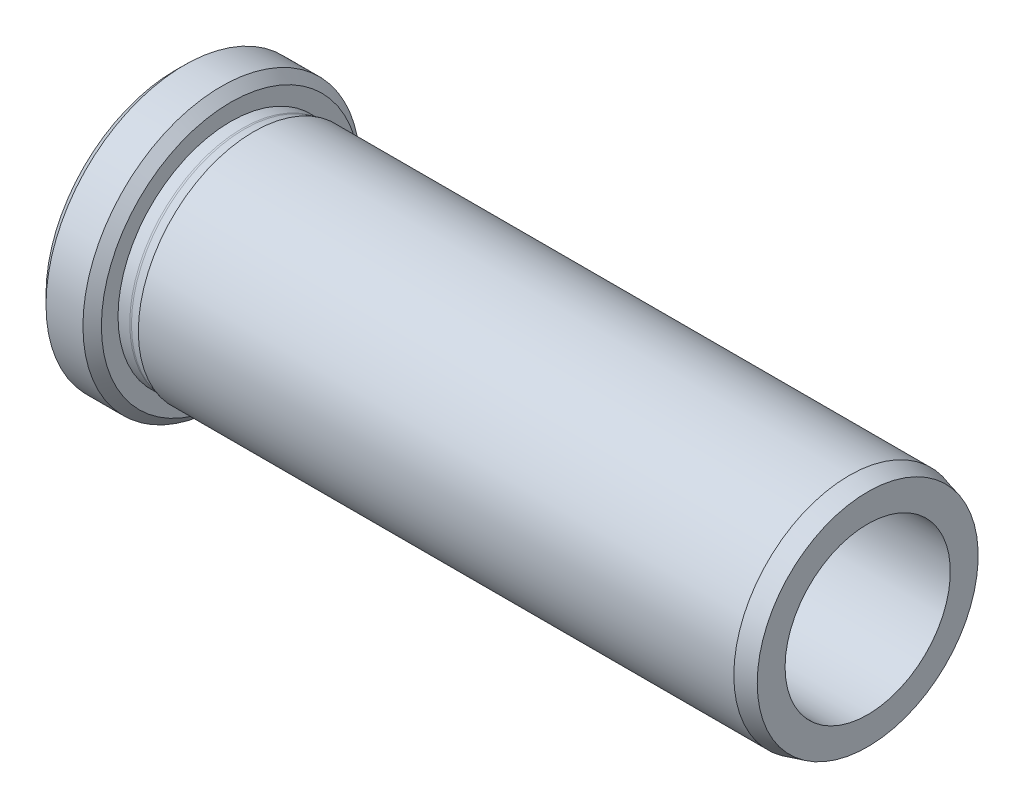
ISO-10303-21;
HEADER;
FILE_DESCRIPTION(('STEP AP214'),'2;1');
FILE_NAME('part.step','',(''),(''),'','','');
FILE_SCHEMA(('AUTOMOTIVE_DESIGN { 1 0 10303 214 1 1 1 1 }'));
ENDSEC;
DATA;
#1=APPLICATION_CONTEXT('core data for automotive mechanical design processes');
#2=APPLICATION_PROTOCOL_DEFINITION('international standard','automotive_design',2000,#1);
#3=PRODUCT_CONTEXT('',#1,'mechanical');
#4=PRODUCT('Part','Part','',(#3));
#5=PRODUCT_RELATED_PRODUCT_CATEGORY('part','',(#4));
#6=PRODUCT_DEFINITION_FORMATION('','',#4);
#7=PRODUCT_DEFINITION_CONTEXT('part definition',#1,'design');
#8=PRODUCT_DEFINITION('design','',#6,#7);
#9=PRODUCT_DEFINITION_SHAPE('','',#8);
#10=(LENGTH_UNIT() NAMED_UNIT(*) SI_UNIT(.MILLI.,.METRE.));
#11=(NAMED_UNIT(*) PLANE_ANGLE_UNIT() SI_UNIT($,.RADIAN.));
#12=(NAMED_UNIT(*) SI_UNIT($,.STERADIAN.) SOLID_ANGLE_UNIT());
#13=UNCERTAINTY_MEASURE_WITH_UNIT(LENGTH_MEASURE(1.E-05),#10,'distance_accuracy_value','');
#14=(GEOMETRIC_REPRESENTATION_CONTEXT(3) GLOBAL_UNCERTAINTY_ASSIGNED_CONTEXT((#13)) GLOBAL_UNIT_ASSIGNED_CONTEXT((#10,
#11,#12)) REPRESENTATION_CONTEXT('',''));
#15=CARTESIAN_POINT('',(0.,0.,0.));
#16=DIRECTION('',(0.,0.,1.));
#17=DIRECTION('',(1.,0.,0.));
#18=AXIS2_PLACEMENT_3D('',#15,#16,#17);
#19=CARTESIAN_POINT('',(30.8004766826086,8.95,0.));
#20=DIRECTION('',(1.,0.,0.));
#21=DIRECTION('',(0.,0.,-1.));
#22=AXIS2_PLACEMENT_3D('',#19,#20,#21);
#23=PLANE('',#22);
#24=CARTESIAN_POINT('',(30.8004766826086,0.,0.));
#25=DIRECTION('',(-1.,0.,0.));
#26=DIRECTION('',(0.,0.,1.));
#27=AXIS2_PLACEMENT_3D('',#24,#25,#26);
#28=CIRCLE('',#27,8.95);
#29=CARTESIAN_POINT('',(30.8004766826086,0.,8.95));
#30=VERTEX_POINT('',#29);
#31=EDGE_CURVE('E64',#30,#30,#28,.T.);
#32=ORIENTED_EDGE('',*,*,#31,.F.);
#33=EDGE_LOOP('',(#32));
#34=FACE_BOUND('',#33,.T.);
#35=CARTESIAN_POINT('',(30.8004766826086,0.,0.));
#36=DIRECTION('',(-1.,0.,0.));
#37=DIRECTION('',(0.,0.,1.));
#38=AXIS2_PLACEMENT_3D('',#35,#36,#37);
#39=CIRCLE('',#38,9.);
#40=CARTESIAN_POINT('',(30.8004766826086,0.,9.));
#41=VERTEX_POINT('',#40);
#42=EDGE_CURVE('E40',#41,#41,#39,.T.);
#43=ORIENTED_EDGE('',*,*,#42,.T.);
#44=EDGE_LOOP('',(#43));
#45=FACE_BOUND('',#44,.T.);
#46=ADVANCED_FACE('F14',(#34,#45),#23,.F.);
#47=CARTESIAN_POINT('',(0.,0.,0.));
#48=DIRECTION('',(-1.,0.,0.));
#49=DIRECTION('',(0.,0.,1.));
#50=AXIS2_PLACEMENT_3D('',#47,#48,#49);
#51=CYLINDRICAL_SURFACE('',#50,9.);
#52=CARTESIAN_POINT('',(2.30047668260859,0.,0.));
#53=DIRECTION('',(1.,0.,0.));
#54=DIRECTION('',(0.,0.,-1.));
#55=AXIS2_PLACEMENT_3D('',#52,#53,#54);
#56=CIRCLE('',#55,9.);
#57=CARTESIAN_POINT('',(2.30047668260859,0.,-9.));
#58=VERTEX_POINT('',#57);
#59=EDGE_CURVE('E29',#58,#58,#56,.F.);
#60=ORIENTED_EDGE('',*,*,#59,.T.);
#61=EDGE_LOOP('',(#60));
#62=FACE_BOUND('',#61,.T.);
#63=ORIENTED_EDGE('',*,*,#42,.F.);
#64=EDGE_LOOP('',(#63));
#65=FACE_BOUND('',#64,.T.);
#66=ADVANCED_FACE('F72',(#62,#65),#51,.F.);
#67=CARTESIAN_POINT('',(0.800476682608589,15.,0.));
#68=DIRECTION('',(1.,0.,0.));
#69=DIRECTION('',(0.,0.,-1.));
#70=AXIS2_PLACEMENT_3D('',#67,#68,#69);
#71=PLANE('',#70);
#72=CARTESIAN_POINT('',(0.800476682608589,0.,0.));
#73=DIRECTION('',(1.,0.,0.));
#74=DIRECTION('',(0.,0.,-1.));
#75=AXIS2_PLACEMENT_3D('',#72,#73,#74);
#76=CIRCLE('',#75,10.5);
#77=CARTESIAN_POINT('',(0.800476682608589,0.,-10.5));
#78=VERTEX_POINT('',#77);
#79=EDGE_CURVE('E25',#78,#78,#76,.T.);
#80=ORIENTED_EDGE('',*,*,#79,.T.);
#81=EDGE_LOOP('',(#80));
#82=FACE_BOUND('',#81,.T.);
#83=CARTESIAN_POINT('',(0.800476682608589,0.,0.));
#84=DIRECTION('',(1.,0.,0.));
#85=DIRECTION('',(0.,0.,-1.));
#86=AXIS2_PLACEMENT_3D('',#83,#84,#85);
#87=CIRCLE('',#86,14.);
#88=CARTESIAN_POINT('',(0.800476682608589,0.,-14.));
#89=VERTEX_POINT('',#88);
#90=EDGE_CURVE('E37',#89,#89,#87,.F.);
#91=ORIENTED_EDGE('',*,*,#90,.T.);
#92=EDGE_LOOP('',(#91));
#93=FACE_BOUND('',#92,.T.);
#94=ADVANCED_FACE('F77',(#82,#93),#71,.F.);
#95=CARTESIAN_POINT('',(0.,0.,0.));
#96=DIRECTION('',(-1.,0.,0.));
#97=DIRECTION('',(0.,0.,1.));
#98=AXIS2_PLACEMENT_3D('',#95,#96,#97);
#99=CYLINDRICAL_SURFACE('',#98,15.);
#100=CARTESIAN_POINT('',(5.8004766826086,0.,0.));
#101=DIRECTION('',(-1.,0.,0.));
#102=DIRECTION('',(0.,0.,1.));
#103=AXIS2_PLACEMENT_3D('',#100,#101,#102);
#104=CIRCLE('',#103,15.);
#105=CARTESIAN_POINT('',(5.8004766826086,0.,15.));
#106=VERTEX_POINT('',#105);
#107=EDGE_CURVE('E21',#106,#106,#104,.T.);
#108=ORIENTED_EDGE('',*,*,#107,.T.);
#109=EDGE_LOOP('',(#108));
#110=FACE_BOUND('',#109,.T.);
#111=CARTESIAN_POINT('',(1.80047668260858,0.,0.));
#112=DIRECTION('',(1.,0.,0.));
#113=DIRECTION('',(0.,0.,-1.));
#114=AXIS2_PLACEMENT_3D('',#111,#112,#113);
#115=CIRCLE('',#114,15.);
#116=CARTESIAN_POINT('',(1.80047668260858,0.,-15.));
#117=VERTEX_POINT('',#116);
#118=EDGE_CURVE('E34',#117,#117,#115,.T.);
#119=ORIENTED_EDGE('',*,*,#118,.T.);
#120=EDGE_LOOP('',(#119));
#121=FACE_BOUND('',#120,.T.);
#122=ADVANCED_FACE('F85',(#110,#121),#99,.T.);
#123=CARTESIAN_POINT('',(6.80047668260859,15.,0.));
#124=DIRECTION('',(-1.,0.,0.));
#125=DIRECTION('',(0.,0.,1.));
#126=AXIS2_PLACEMENT_3D('',#123,#124,#125);
#127=PLANE('',#126);
#128=CARTESIAN_POINT('',(6.80047668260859,0.,0.));
#129=DIRECTION('',(-1.,0.,0.));
#130=DIRECTION('',(0.,0.,1.));
#131=AXIS2_PLACEMENT_3D('',#128,#129,#130);
#132=CIRCLE('',#131,14.);
#133=CARTESIAN_POINT('',(6.80047668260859,0.,14.));
#134=VERTEX_POINT('',#133);
#135=EDGE_CURVE('E9',#134,#134,#132,.F.);
#136=ORIENTED_EDGE('',*,*,#135,.T.);
#137=EDGE_LOOP('',(#136));
#138=FACE_BOUND('',#137,.T.);
#139=CARTESIAN_POINT('',(6.80047668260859,0.,0.));
#140=DIRECTION('',(-1.,0.,0.));
#141=DIRECTION('',(0.,0.,1.));
#142=AXIS2_PLACEMENT_3D('',#139,#140,#141);
#143=CIRCLE('',#142,12.2);
#144=CARTESIAN_POINT('',(6.80047668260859,0.,12.2));
#145=VERTEX_POINT('',#144);
#146=EDGE_CURVE('E43',#145,#145,#143,.T.);
#147=ORIENTED_EDGE('',*,*,#146,.T.);
#148=EDGE_LOOP('',(#147));
#149=FACE_BOUND('',#148,.T.);
#150=ADVANCED_FACE('F124',(#138,#149),#127,.F.);
#151=CARTESIAN_POINT('',(0.,0.,0.));
#152=DIRECTION('',(-1.,0.,0.));
#153=DIRECTION('',(0.,0.,1.));
#154=AXIS2_PLACEMENT_3D('',#151,#152,#153);
#155=CYLINDRICAL_SURFACE('',#154,12.2);
#156=ORIENTED_EDGE('',*,*,#146,.F.);
#157=EDGE_LOOP('',(#156));
#158=FACE_BOUND('',#157,.T.);
#159=CARTESIAN_POINT('',(8.07553944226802,0.,0.));
#160=DIRECTION('',(-1.,0.,0.));
#161=DIRECTION('',(0.,0.,1.));
#162=AXIS2_PLACEMENT_3D('',#159,#160,#161);
#163=CIRCLE('',#162,12.2);
#164=CARTESIAN_POINT('',(8.07553944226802,0.,12.2));
#165=VERTEX_POINT('',#164);
#166=EDGE_CURVE('E46',#165,#165,#163,.T.);
#167=ORIENTED_EDGE('',*,*,#166,.T.);
#168=EDGE_LOOP('',(#167));
#169=FACE_BOUND('',#168,.T.);
#170=ADVANCED_FACE('F129',(#158,#169),#155,.T.);
#171=CARTESIAN_POINT('',(8.07553944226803,0.,0.));
#172=DIRECTION('',(-1.,0.,0.));
#173=DIRECTION('',(0.,0.,1.));
#174=AXIS2_PLACEMENT_3D('',#171,#172,#173);
#175=TOROIDAL_SURFACE('',#174,13.,0.8);
#176=ORIENTED_EDGE('',*,*,#166,.F.);
#177=EDGE_LOOP('',(#176));
#178=FACE_BOUND('',#177,.T.);
#179=CARTESIAN_POINT('',(8.28259467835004,0.,0.));
#180=DIRECTION('',(-1.,0.,0.));
#181=DIRECTION('',(0.,0.,1.));
#182=AXIS2_PLACEMENT_3D('',#179,#180,#181);
#183=CIRCLE('',#182,12.2272593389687);
#184=CARTESIAN_POINT('',(8.28259467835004,0.,12.2272593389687));
#185=VERTEX_POINT('',#184);
#186=EDGE_CURVE('E49',#185,#185,#183,.T.);
#187=ORIENTED_EDGE('',*,*,#186,.T.);
#188=EDGE_LOOP('',(#187));
#189=FACE_BOUND('',#188,.T.);
#190=ADVANCED_FACE('F189',(#178,#189),#175,.F.);
#191=CARTESIAN_POINT('',(9.30047668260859,0.,0.));
#192=DIRECTION('',(1.,0.,0.));
#193=DIRECTION('',(0.,0.,-1.));
#194=AXIS2_PLACEMENT_3D('',#191,#192,#193);
#195=CONICAL_SURFACE('',#194,12.5,0.261799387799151);
#196=ORIENTED_EDGE('',*,*,#186,.F.);
#197=EDGE_LOOP('',(#196));
#198=FACE_BOUND('',#197,.T.);
#199=CARTESIAN_POINT('',(9.30047668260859,0.,0.));
#200=DIRECTION('',(-1.,0.,0.));
#201=DIRECTION('',(0.,0.,1.));
#202=AXIS2_PLACEMENT_3D('',#199,#200,#201);
#203=CIRCLE('',#202,12.5);
#204=CARTESIAN_POINT('',(9.30047668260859,0.,12.5));
#205=VERTEX_POINT('',#204);
#206=EDGE_CURVE('E52',#205,#205,#203,.T.);
#207=ORIENTED_EDGE('',*,*,#206,.T.);
#208=EDGE_LOOP('',(#207));
#209=FACE_BOUND('',#208,.T.);
#210=ADVANCED_FACE('F179',(#198,#209),#195,.T.);
#211=CARTESIAN_POINT('',(0.,0.,0.));
#212=DIRECTION('',(-1.,0.,0.));
#213=DIRECTION('',(0.,0.,1.));
#214=AXIS2_PLACEMENT_3D('',#211,#212,#213);
#215=CYLINDRICAL_SURFACE('',#214,12.5);
#216=ORIENTED_EDGE('',*,*,#206,.F.);
#217=EDGE_LOOP('',(#216));
#218=FACE_BOUND('',#217,.T.);
#219=CARTESIAN_POINT('',(73.8004766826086,0.,0.));
#220=DIRECTION('',(-1.,0.,0.));
#221=DIRECTION('',(0.,0.,1.));
#222=AXIS2_PLACEMENT_3D('',#219,#220,#221);
#223=CIRCLE('',#222,12.5);
#224=CARTESIAN_POINT('',(73.8004766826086,0.,12.5));
#225=VERTEX_POINT('',#224);
#226=EDGE_CURVE('E55',#225,#225,#223,.T.);
#227=ORIENTED_EDGE('',*,*,#226,.T.);
#228=EDGE_LOOP('',(#227));
#229=FACE_BOUND('',#228,.T.);
#230=ADVANCED_FACE('F169',(#218,#229),#215,.T.);
#231=CARTESIAN_POINT('',(75.8004766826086,0.,0.));
#232=DIRECTION('',(-1.,0.,0.));
#233=DIRECTION('',(0.,0.,1.));
#234=AXIS2_PLACEMENT_3D('',#231,#232,#233);
#235=CONICAL_SURFACE('',#234,11.9641016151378,0.26179938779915);
#236=ORIENTED_EDGE('',*,*,#226,.F.);
#237=EDGE_LOOP('',(#236));
#238=FACE_BOUND('',#237,.T.);
#239=CARTESIAN_POINT('',(75.8004766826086,0.,0.));
#240=DIRECTION('',(-1.,0.,0.));
#241=DIRECTION('',(0.,0.,1.));
#242=AXIS2_PLACEMENT_3D('',#239,#240,#241);
#243=CIRCLE('',#242,11.9641016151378);
#244=CARTESIAN_POINT('',(75.8004766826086,0.,11.9641016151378));
#245=VERTEX_POINT('',#244);
#246=EDGE_CURVE('E58',#245,#245,#243,.T.);
#247=ORIENTED_EDGE('',*,*,#246,.T.);
#248=EDGE_LOOP('',(#247));
#249=FACE_BOUND('',#248,.T.);
#250=ADVANCED_FACE('F159',(#238,#249),#235,.T.);
#251=CARTESIAN_POINT('',(75.8004766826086,11.9641016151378,0.));
#252=DIRECTION('',(-1.,0.,0.));
#253=DIRECTION('',(0.,0.,1.));
#254=AXIS2_PLACEMENT_3D('',#251,#252,#253);
#255=PLANE('',#254);
#256=ORIENTED_EDGE('',*,*,#246,.F.);
#257=EDGE_LOOP('',(#256));
#258=FACE_BOUND('',#257,.T.);
#259=CARTESIAN_POINT('',(75.8004766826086,0.,0.));
#260=DIRECTION('',(-1.,0.,0.));
#261=DIRECTION('',(0.,0.,1.));
#262=AXIS2_PLACEMENT_3D('',#259,#260,#261);
#263=CIRCLE('',#262,8.95);
#264=CARTESIAN_POINT('',(75.8004766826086,0.,8.95));
#265=VERTEX_POINT('',#264);
#266=EDGE_CURVE('E61',#265,#265,#263,.T.);
#267=ORIENTED_EDGE('',*,*,#266,.T.);
#268=EDGE_LOOP('',(#267));
#269=FACE_BOUND('',#268,.T.);
#270=ADVANCED_FACE('F148',(#258,#269),#255,.F.);
#271=CARTESIAN_POINT('',(0.,0.,0.));
#272=DIRECTION('',(-1.,0.,0.));
#273=DIRECTION('',(0.,0.,1.));
#274=AXIS2_PLACEMENT_3D('',#271,#272,#273);
#275=CYLINDRICAL_SURFACE('',#274,8.95);
#276=ORIENTED_EDGE('',*,*,#266,.F.);
#277=EDGE_LOOP('',(#276));
#278=FACE_BOUND('',#277,.T.);
#279=ORIENTED_EDGE('',*,*,#31,.T.);
#280=EDGE_LOOP('',(#279));
#281=FACE_BOUND('',#280,.T.);
#282=ADVANCED_FACE('F68',(#278,#281),#275,.F.);
#283=CARTESIAN_POINT('',(0.800476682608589,0.,0.));
#284=DIRECTION('',(1.,0.,0.));
#285=DIRECTION('',(0.,0.,-1.));
#286=AXIS2_PLACEMENT_3D('',#283,#284,#285);
#287=CONICAL_SURFACE('',#286,14.,0.78539816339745);
#288=ORIENTED_EDGE('',*,*,#118,.F.);
#289=EDGE_LOOP('',(#288));
#290=FACE_BOUND('',#289,.T.);
#291=ORIENTED_EDGE('',*,*,#90,.F.);
#292=EDGE_LOOP('',(#291));
#293=FACE_BOUND('',#292,.T.);
#294=ADVANCED_FACE('F90',(#290,#293),#287,.T.);
#295=CARTESIAN_POINT('',(2.30047668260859,0.,0.));
#296=DIRECTION('',(1.,0.,0.));
#297=DIRECTION('',(0.,0.,-1.));
#298=AXIS2_PLACEMENT_3D('',#295,#296,#297);
#299=TOROIDAL_SURFACE('',#298,10.5,1.5);
#300=ORIENTED_EDGE('',*,*,#79,.F.);
#301=EDGE_LOOP('',(#300));
#302=FACE_BOUND('',#301,.T.);
#303=ORIENTED_EDGE('',*,*,#59,.F.);
#304=EDGE_LOOP('',(#303));
#305=FACE_BOUND('',#304,.T.);
#306=ADVANCED_FACE('F92',(#302,#305),#299,.T.);
#307=CARTESIAN_POINT('',(5.8004766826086,0.,0.));
#308=DIRECTION('',(-1.,0.,0.));
#309=DIRECTION('',(0.,0.,1.));
#310=AXIS2_PLACEMENT_3D('',#307,#308,#309);
#311=CONICAL_SURFACE('',#310,15.,0.78539816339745);
#312=ORIENTED_EDGE('',*,*,#135,.F.);
#313=EDGE_LOOP('',(#312));
#314=FACE_BOUND('',#313,.T.);
#315=ORIENTED_EDGE('',*,*,#107,.F.);
#316=EDGE_LOOP('',(#315));
#317=FACE_BOUND('',#316,.T.);
#318=ADVANCED_FACE('F16',(#314,#317),#311,.T.);
#319=CLOSED_SHELL('',(#46,#66,#94,#122,#150,#170,#190,#210,#230,#250,#270,#282,#294,#306,#318));
#320=MANIFOLD_SOLID_BREP('B1',#319);
#321=ADVANCED_BREP_SHAPE_REPRESENTATION('',(#18,#320),#14);
#322=SHAPE_DEFINITION_REPRESENTATION(#9,#321);
ENDSEC;
END-ISO-10303-21;
